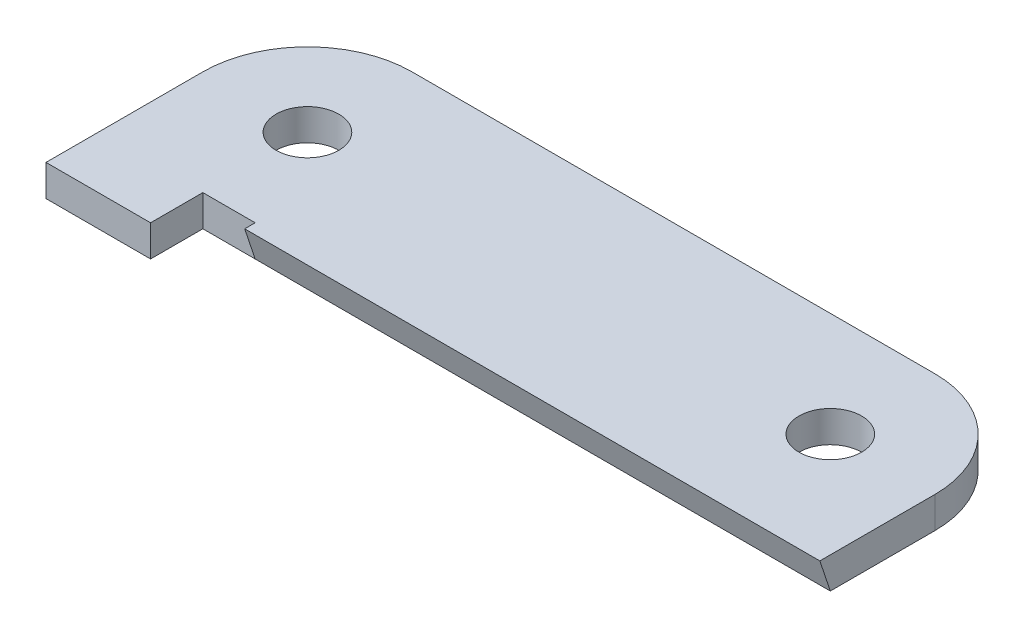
from build123d import *

# Parameters (mm, degrees)
SKETCH1_R          = 3
EXTRUDE1_DEPTH     = 3
CUT_EXTRUDE1_DEPTH = 55


with BuildPart() as part:
    # Sketch1 → Extrude1 (new body)
    with BuildSketch(Plane(origin=(0, 0, 0), x_dir=(1, 0, 0), z_dir=(0, 1, 0))):
        with BuildLine():
            Line((10, 0), (10, 5))
            Line((10, 5), (15, 5))
            Line((15, 5), (15, 4))
            Line((15, 4), (70, 4))
            Line((70, 4), (70, 15))
            ThreePointArc((70, 15), (67.071067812, 22.071067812), (60, 25))
            Line((60, 25), (10, 25))
            ThreePointArc((10, 25), (2.928932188, 22.071067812), (0, 15))
            Line((0, 15), (0, 0))
            Line((0, 0), (10, 0))
        make_face()
        with Locations(Location((10, 15, 0), (0, 0, 270))):
            Circle(SKETCH1_R, mode=Mode.SUBTRACT)
        with Locations(Location((60, 15, 0), (0, 0, 270))):
            Circle(SKETCH1_R, mode=Mode.SUBTRACT)
    extrude(amount=EXTRUDE1_DEPTH)

    # Sketch2 → Cut-Extrude1 (cut)
    with BuildSketch(Plane(origin=(70, 0, 0), x_dir=(0, 0, -1), z_dir=(1, 0, 0))):
        Polygon((4, 3), (4, 0), (5, 0), align=None)
    extrude(amount=-CUT_EXTRUDE1_DEPTH, mode=Mode.SUBTRACT)


solid = part.part
